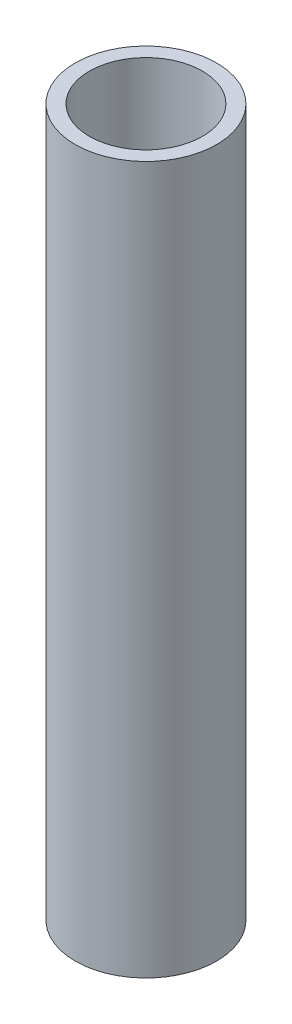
from build123d import *

# Parameters (mm, degrees)
ESQUISSE1_R      = 5
ESQUISSE1_R_2    = 4
EXTRUSION1_DEPTH = 50


with BuildPart() as part:
    # Esquisse1 → Extrusion1 (new body)
    with BuildSketch(Plane(origin=(0, 0, 0), x_dir=(1, 0, 0), z_dir=(0, 1, 0))):
        with Locations(Location((0, 0, 0), (0, 0, 270))):
            Circle(ESQUISSE1_R)
        with Locations(Location((0, 0, 0), (0, 0, 270))):
            Circle(ESQUISSE1_R_2, mode=Mode.SUBTRACT)
    extrude(amount=-EXTRUSION1_DEPTH)


solid = part.part
